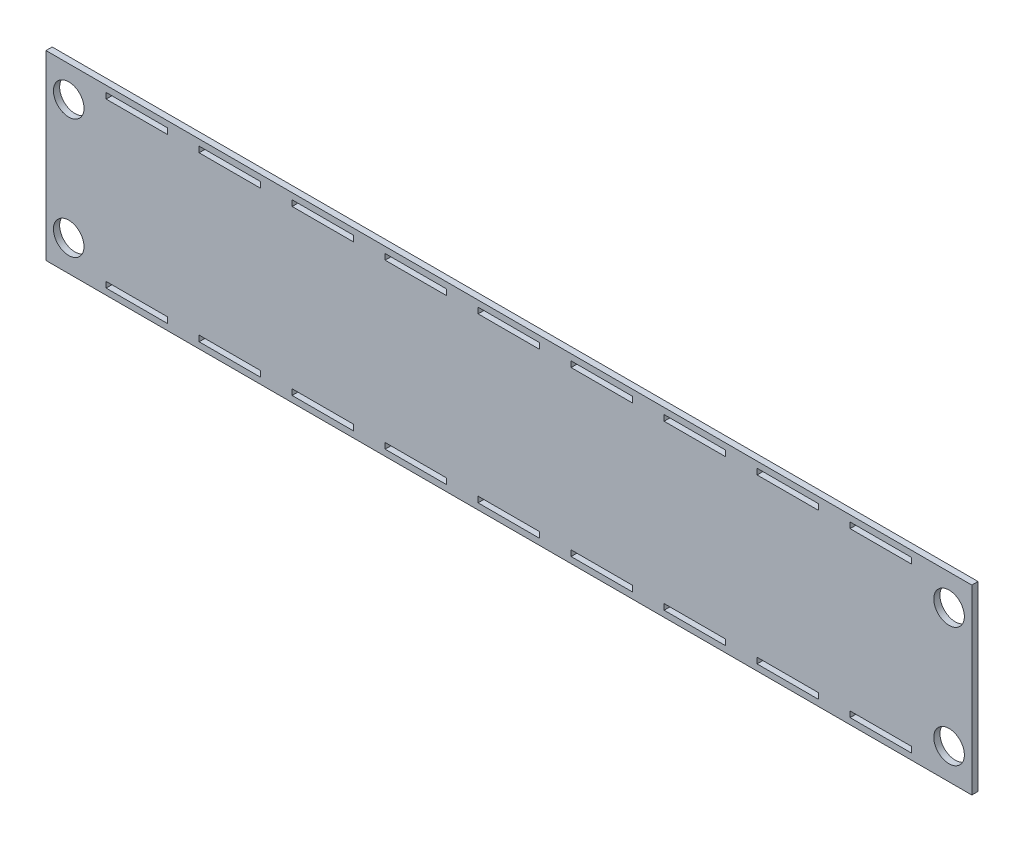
from build123d import *

# Parameters (mm, degrees)
CROQUIS1_W              = 448
CROQUIS1_H              = 88
SALIENTE_EXTRUIR1_DEPTH = 3
CORTAR_EXTRUIR1_REACH   = 230.3
CROQUIS2_W              = 29.8
CROQUIS2_H              = 2.8
CORTAR_EXTRUIR2_REACH   = 230.3
CROQUIS3_R              = 7.4


with BuildPart() as part:
    # Croquis1 → Saliente-Extruir1 (new body)
    with BuildSketch(Plane.XY):
        Rectangle(CROQUIS1_W, CROQUIS1_H)
    extrude(amount=SALIENTE_EXTRUIR1_DEPTH)

    # Croquis2 → Cortar-Extruir1 (cut, up to next)
    with BuildSketch(Plane.XY.offset(3), mode=Mode.PRIVATE) as cortar_extruir1_sk1:
        with Locations((0, 39.6)):
            Rectangle(CROQUIS2_W, CROQUIS2_H)
    cortar_extruir1_tool1 = extrude(cortar_extruir1_sk1.sketch, amount=-CORTAR_EXTRUIR1_REACH, mode=Mode.PRIVATE) & part.part
    # Croquis2 → Cortar-Extruir1 (cut, up to next)
    with BuildSketch(Plane.XY.offset(3), mode=Mode.PRIVATE) as cortar_extruir1_sk2:
        with Locations((-180, -39.6)):
            Rectangle(CROQUIS2_W, CROQUIS2_H)
    cortar_extruir1_tool2 = extrude(cortar_extruir1_sk2.sketch, amount=-CORTAR_EXTRUIR1_REACH, mode=Mode.PRIVATE) & part.part
    # Croquis2 → Cortar-Extruir1 (cut, up to next)
    with BuildSketch(Plane.XY.offset(3), mode=Mode.PRIVATE) as cortar_extruir1_sk3:
        with Locations((-135, -39.6)):
            Rectangle(CROQUIS2_W, CROQUIS2_H)
    cortar_extruir1_tool3 = extrude(cortar_extruir1_sk3.sketch, amount=-CORTAR_EXTRUIR1_REACH, mode=Mode.PRIVATE) & part.part
    # Croquis2 → Cortar-Extruir1 (cut, up to next)
    with BuildSketch(Plane.XY.offset(3), mode=Mode.PRIVATE) as cortar_extruir1_sk4:
        with Locations((-90, -39.6)):
            Rectangle(CROQUIS2_W, CROQUIS2_H)
    cortar_extruir1_tool4 = extrude(cortar_extruir1_sk4.sketch, amount=-CORTAR_EXTRUIR1_REACH, mode=Mode.PRIVATE) & part.part
    # Croquis2 → Cortar-Extruir1 (cut, up to next)
    with BuildSketch(Plane.XY.offset(3), mode=Mode.PRIVATE) as cortar_extruir1_sk5:
        with Locations((-45, -39.6)):
            Rectangle(CROQUIS2_W, CROQUIS2_H)
    cortar_extruir1_tool5 = extrude(cortar_extruir1_sk5.sketch, amount=-CORTAR_EXTRUIR1_REACH, mode=Mode.PRIVATE) & part.part
    # Croquis2 → Cortar-Extruir1 (cut, up to next)
    with BuildSketch(Plane.XY.offset(3), mode=Mode.PRIVATE) as cortar_extruir1_sk6:
        with Locations((0, -39.6)):
            Rectangle(CROQUIS2_W, CROQUIS2_H)
    cortar_extruir1_tool6 = extrude(cortar_extruir1_sk6.sketch, amount=-CORTAR_EXTRUIR1_REACH, mode=Mode.PRIVATE) & part.part
    # Croquis2 → Cortar-Extruir1 (cut, up to next)
    with BuildSketch(Plane.XY.offset(3), mode=Mode.PRIVATE) as cortar_extruir1_sk7:
        with Locations((-45, 39.6)):
            Rectangle(CROQUIS2_W, CROQUIS2_H)
    cortar_extruir1_tool7 = extrude(cortar_extruir1_sk7.sketch, amount=-CORTAR_EXTRUIR1_REACH, mode=Mode.PRIVATE) & part.part
    # Croquis2 → Cortar-Extruir1 (cut, up to next)
    with BuildSketch(Plane.XY.offset(3), mode=Mode.PRIVATE) as cortar_extruir1_sk8:
        with Locations((-90, 39.6)):
            Rectangle(CROQUIS2_W, CROQUIS2_H)
    cortar_extruir1_tool8 = extrude(cortar_extruir1_sk8.sketch, amount=-CORTAR_EXTRUIR1_REACH, mode=Mode.PRIVATE) & part.part
    # Croquis2 → Cortar-Extruir1 (cut, up to next)
    with BuildSketch(Plane.XY.offset(3), mode=Mode.PRIVATE) as cortar_extruir1_sk9:
        with Locations((-135, 39.6)):
            Rectangle(CROQUIS2_W, CROQUIS2_H)
    cortar_extruir1_tool9 = extrude(cortar_extruir1_sk9.sketch, amount=-CORTAR_EXTRUIR1_REACH, mode=Mode.PRIVATE) & part.part
    # Croquis2 → Cortar-Extruir1 (cut, up to next)
    with BuildSketch(Plane.XY.offset(3), mode=Mode.PRIVATE) as cortar_extruir1_sk10:
        with Locations((-180, 39.6)):
            Rectangle(CROQUIS2_W, CROQUIS2_H)
    cortar_extruir1_tool10 = extrude(cortar_extruir1_sk10.sketch, amount=-CORTAR_EXTRUIR1_REACH, mode=Mode.PRIVATE) & part.part
    # Croquis2 → Cortar-Extruir1 (cut, up to next)
    with BuildSketch(Plane.XY.offset(3), mode=Mode.PRIVATE) as cortar_extruir1_sk11:
        with Locations((180, 39.6)):
            Rectangle(CROQUIS2_W, CROQUIS2_H)
    cortar_extruir1_tool11 = extrude(cortar_extruir1_sk11.sketch, amount=-CORTAR_EXTRUIR1_REACH, mode=Mode.PRIVATE) & part.part
    # Croquis2 → Cortar-Extruir1 (cut, up to next)
    with BuildSketch(Plane.XY.offset(3), mode=Mode.PRIVATE) as cortar_extruir1_sk12:
        with Locations((135, 39.6)):
            Rectangle(CROQUIS2_W, CROQUIS2_H)
    cortar_extruir1_tool12 = extrude(cortar_extruir1_sk12.sketch, amount=-CORTAR_EXTRUIR1_REACH, mode=Mode.PRIVATE) & part.part
    # Croquis2 → Cortar-Extruir1 (cut, up to next)
    with BuildSketch(Plane.XY.offset(3), mode=Mode.PRIVATE) as cortar_extruir1_sk13:
        with Locations((90, 39.6)):
            Rectangle(CROQUIS2_W, CROQUIS2_H)
    cortar_extruir1_tool13 = extrude(cortar_extruir1_sk13.sketch, amount=-CORTAR_EXTRUIR1_REACH, mode=Mode.PRIVATE) & part.part
    # Croquis2 → Cortar-Extruir1 (cut, up to next)
    with BuildSketch(Plane.XY.offset(3), mode=Mode.PRIVATE) as cortar_extruir1_sk14:
        with Locations((45, 39.6)):
            Rectangle(CROQUIS2_W, CROQUIS2_H)
    cortar_extruir1_tool14 = extrude(cortar_extruir1_sk14.sketch, amount=-CORTAR_EXTRUIR1_REACH, mode=Mode.PRIVATE) & part.part
    # Croquis2 → Cortar-Extruir1 (cut, up to next)
    with BuildSketch(Plane.XY.offset(3), mode=Mode.PRIVATE) as cortar_extruir1_sk15:
        with Locations((45, -39.6)):
            Rectangle(CROQUIS2_W, CROQUIS2_H)
    cortar_extruir1_tool15 = extrude(cortar_extruir1_sk15.sketch, amount=-CORTAR_EXTRUIR1_REACH, mode=Mode.PRIVATE) & part.part
    # Croquis2 → Cortar-Extruir1 (cut, up to next)
    with BuildSketch(Plane.XY.offset(3), mode=Mode.PRIVATE) as cortar_extruir1_sk16:
        with Locations((90, -39.6)):
            Rectangle(CROQUIS2_W, CROQUIS2_H)
    cortar_extruir1_tool16 = extrude(cortar_extruir1_sk16.sketch, amount=-CORTAR_EXTRUIR1_REACH, mode=Mode.PRIVATE) & part.part
    # Croquis2 → Cortar-Extruir1 (cut, up to next)
    with BuildSketch(Plane.XY.offset(3), mode=Mode.PRIVATE) as cortar_extruir1_sk17:
        with Locations((135, -39.6)):
            Rectangle(CROQUIS2_W, CROQUIS2_H)
    cortar_extruir1_tool17 = extrude(cortar_extruir1_sk17.sketch, amount=-CORTAR_EXTRUIR1_REACH, mode=Mode.PRIVATE) & part.part
    # Croquis2 → Cortar-Extruir1 (cut, up to next)
    with BuildSketch(Plane.XY.offset(3), mode=Mode.PRIVATE) as cortar_extruir1_sk18:
        with Locations((180, -39.6)):
            Rectangle(CROQUIS2_W, CROQUIS2_H)
    cortar_extruir1_tool18 = extrude(cortar_extruir1_sk18.sketch, amount=-CORTAR_EXTRUIR1_REACH, mode=Mode.PRIVATE) & part.part
    add(cortar_extruir1_tool1.solids().sort_by_distance((0, 39.6, 3))[0], mode=Mode.SUBTRACT)
    add(cortar_extruir1_tool2.solids().sort_by_distance((-180, -39.6, 3))[0], mode=Mode.SUBTRACT)
    add(cortar_extruir1_tool3.solids().sort_by_distance((-135, -39.6, 3))[0], mode=Mode.SUBTRACT)
    add(cortar_extruir1_tool4.solids().sort_by_distance((-90, -39.6, 3))[0], mode=Mode.SUBTRACT)
    add(cortar_extruir1_tool5.solids().sort_by_distance((-45, -39.6, 3))[0], mode=Mode.SUBTRACT)
    add(cortar_extruir1_tool6.solids().sort_by_distance((0, -39.6, 3))[0], mode=Mode.SUBTRACT)
    add(cortar_extruir1_tool7.solids().sort_by_distance((-45, 39.6, 3))[0], mode=Mode.SUBTRACT)
    add(cortar_extruir1_tool8.solids().sort_by_distance((-90, 39.6, 3))[0], mode=Mode.SUBTRACT)
    add(cortar_extruir1_tool9.solids().sort_by_distance((-135, 39.6, 3))[0], mode=Mode.SUBTRACT)
    add(cortar_extruir1_tool10.solids().sort_by_distance((-180, 39.6, 3))[0], mode=Mode.SUBTRACT)
    add(cortar_extruir1_tool11.solids().sort_by_distance((180, 39.6, 3))[0], mode=Mode.SUBTRACT)
    add(cortar_extruir1_tool12.solids().sort_by_distance((135, 39.6, 3))[0], mode=Mode.SUBTRACT)
    add(cortar_extruir1_tool13.solids().sort_by_distance((90, 39.6, 3))[0], mode=Mode.SUBTRACT)
    add(cortar_extruir1_tool14.solids().sort_by_distance((45, 39.6, 3))[0], mode=Mode.SUBTRACT)
    add(cortar_extruir1_tool15.solids().sort_by_distance((45, -39.6, 3))[0], mode=Mode.SUBTRACT)
    add(cortar_extruir1_tool16.solids().sort_by_distance((90, -39.6, 3))[0], mode=Mode.SUBTRACT)
    add(cortar_extruir1_tool17.solids().sort_by_distance((135, -39.6, 3))[0], mode=Mode.SUBTRACT)
    add(cortar_extruir1_tool18.solids().sort_by_distance((180, -39.6, 3))[0], mode=Mode.SUBTRACT)

    # Croquis3 → Cortar-Extruir2 (cut, up to next)
    with BuildSketch(Plane.XY.offset(3), mode=Mode.PRIVATE) as cortar_extruir2_sk1:
        with Locations((-213, 29)):
            Circle(CROQUIS3_R)
    cortar_extruir2_tool1 = extrude(cortar_extruir2_sk1.sketch, amount=-CORTAR_EXTRUIR2_REACH, mode=Mode.PRIVATE) & part.part
    # Croquis3 → Cortar-Extruir2 (cut, up to next)
    with BuildSketch(Plane.XY.offset(3), mode=Mode.PRIVATE) as cortar_extruir2_sk2:
        with Locations((-213, -29)):
            Circle(CROQUIS3_R)
    cortar_extruir2_tool2 = extrude(cortar_extruir2_sk2.sketch, amount=-CORTAR_EXTRUIR2_REACH, mode=Mode.PRIVATE) & part.part
    # Croquis3 → Cortar-Extruir2 (cut, up to next)
    with BuildSketch(Plane.XY.offset(3), mode=Mode.PRIVATE) as cortar_extruir2_sk3:
        with Locations((213, -29)):
            Circle(CROQUIS3_R)
    cortar_extruir2_tool3 = extrude(cortar_extruir2_sk3.sketch, amount=-CORTAR_EXTRUIR2_REACH, mode=Mode.PRIVATE) & part.part
    # Croquis3 → Cortar-Extruir2 (cut, up to next)
    with BuildSketch(Plane.XY.offset(3), mode=Mode.PRIVATE) as cortar_extruir2_sk4:
        with Locations((213, 29)):
            Circle(CROQUIS3_R)
    cortar_extruir2_tool4 = extrude(cortar_extruir2_sk4.sketch, amount=-CORTAR_EXTRUIR2_REACH, mode=Mode.PRIVATE) & part.part
    add(cortar_extruir2_tool1.solids().sort_by_distance((-213, 29, 3))[0], mode=Mode.SUBTRACT)
    add(cortar_extruir2_tool2.solids().sort_by_distance((-213, -29, 3))[0], mode=Mode.SUBTRACT)
    add(cortar_extruir2_tool3.solids().sort_by_distance((213, -29, 3))[0], mode=Mode.SUBTRACT)
    add(cortar_extruir2_tool4.solids().sort_by_distance((213, 29, 3))[0], mode=Mode.SUBTRACT)


solid = part.part
